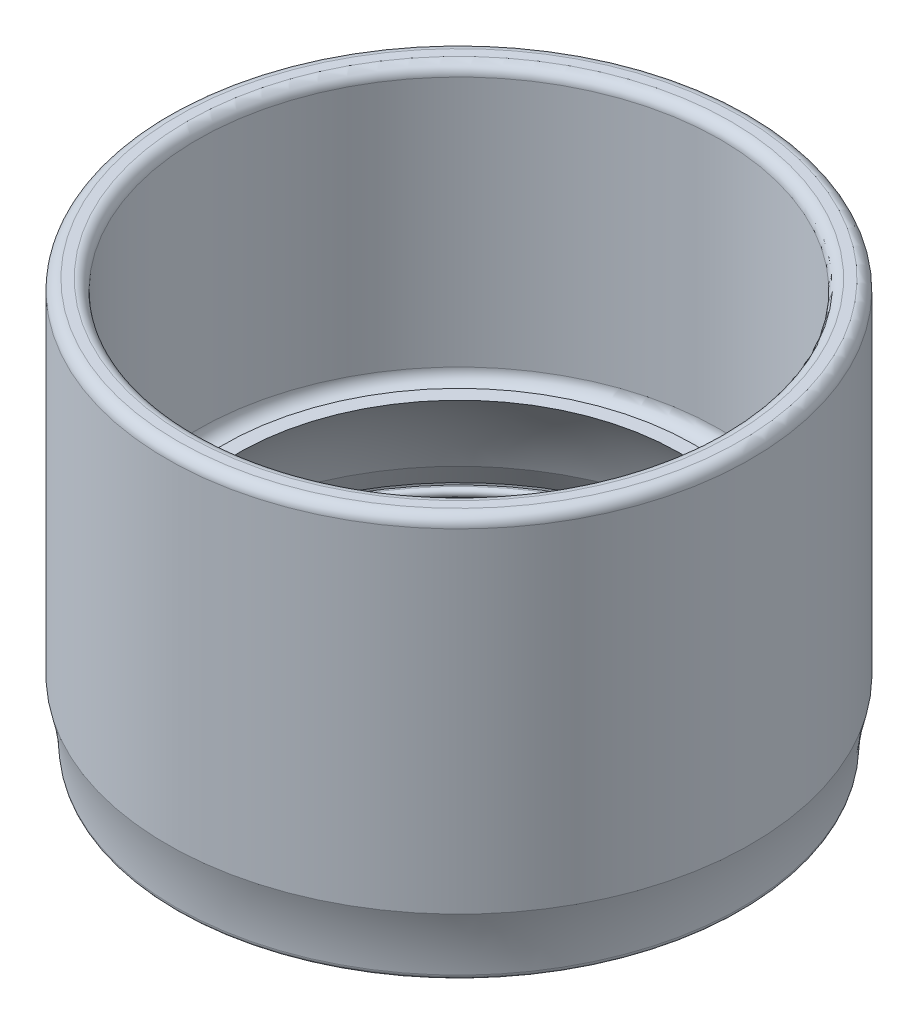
ISO-10303-21;
HEADER;
FILE_DESCRIPTION(('STEP AP214'),'2;1');
FILE_NAME('part.step','',(''),(''),'','','');
FILE_SCHEMA(('AUTOMOTIVE_DESIGN { 1 0 10303 214 1 1 1 1 }'));
ENDSEC;
DATA;
#1=APPLICATION_CONTEXT('core data for automotive mechanical design processes');
#2=APPLICATION_PROTOCOL_DEFINITION('international standard','automotive_design',2000,#1);
#3=PRODUCT_CONTEXT('',#1,'mechanical');
#4=PRODUCT('Part','Part','',(#3));
#5=PRODUCT_RELATED_PRODUCT_CATEGORY('part','',(#4));
#6=PRODUCT_DEFINITION_FORMATION('','',#4);
#7=PRODUCT_DEFINITION_CONTEXT('part definition',#1,'design');
#8=PRODUCT_DEFINITION('design','',#6,#7);
#9=PRODUCT_DEFINITION_SHAPE('','',#8);
#10=(LENGTH_UNIT() NAMED_UNIT(*) SI_UNIT(.MILLI.,.METRE.));
#11=(NAMED_UNIT(*) PLANE_ANGLE_UNIT() SI_UNIT($,.RADIAN.));
#12=(NAMED_UNIT(*) SI_UNIT($,.STERADIAN.) SOLID_ANGLE_UNIT());
#13=UNCERTAINTY_MEASURE_WITH_UNIT(LENGTH_MEASURE(1.E-05),#10,'distance_accuracy_value','');
#14=(GEOMETRIC_REPRESENTATION_CONTEXT(3) GLOBAL_UNCERTAINTY_ASSIGNED_CONTEXT((#13)) GLOBAL_UNIT_ASSIGNED_CONTEXT((#10,
#11,#12)) REPRESENTATION_CONTEXT('',''));
#15=CARTESIAN_POINT('',(0.,0.,0.));
#16=DIRECTION('',(0.,0.,1.));
#17=DIRECTION('',(1.,0.,0.));
#18=AXIS2_PLACEMENT_3D('',#15,#16,#17);
#19=CARTESIAN_POINT('',(0.,0.,0.));
#20=DIRECTION('',(0.,-1.,0.));
#21=DIRECTION('',(0.,0.,-1.));
#22=AXIS2_PLACEMENT_3D('',#19,#20,#21);
#23=CYLINDRICAL_SURFACE('',#22,82.7532);
#24=CARTESIAN_POINT('',(0.,11.7602,0.));
#25=DIRECTION('',(0.,-1.,0.));
#26=DIRECTION('',(0.,0.,-1.));
#27=AXIS2_PLACEMENT_3D('',#24,#25,#26);
#28=CIRCLE('',#27,82.7532);
#29=CARTESIAN_POINT('',(0.,11.7602,-82.7532));
#30=VERTEX_POINT('',#29);
#31=EDGE_CURVE('E81',#30,#30,#28,.T.);
#32=ORIENTED_EDGE('',*,*,#31,.F.);
#33=EDGE_LOOP('',(#32));
#34=FACE_BOUND('',#33,.T.);
#35=CARTESIAN_POINT('',(0.,11.1252,0.));
#36=DIRECTION('',(0.,-1.,0.));
#37=DIRECTION('',(0.,0.,-1.));
#38=AXIS2_PLACEMENT_3D('',#35,#36,#37);
#39=CIRCLE('',#38,82.7532);
#40=CARTESIAN_POINT('',(0.,11.1252,-82.7532));
#41=VERTEX_POINT('',#40);
#42=EDGE_CURVE('E51',#41,#41,#39,.T.);
#43=ORIENTED_EDGE('',*,*,#42,.T.);
#44=EDGE_LOOP('',(#43));
#45=FACE_BOUND('',#44,.T.);
#46=ADVANCED_FACE('F26',(#34,#45),#23,.F.);
#47=CARTESIAN_POINT('',(-82.7532,11.1252,0.));
#48=DIRECTION('',(0.,-1.,0.));
#49=DIRECTION('',(0.,0.,-1.));
#50=AXIS2_PLACEMENT_3D('',#47,#48,#49);
#51=PLANE('',#50);
#52=ORIENTED_EDGE('',*,*,#42,.F.);
#53=EDGE_LOOP('',(#52));
#54=FACE_BOUND('',#53,.T.);
#55=CARTESIAN_POINT('',(0.,11.1252,0.));
#56=DIRECTION('',(0.,-1.,0.));
#57=DIRECTION('',(0.,0.,-1.));
#58=AXIS2_PLACEMENT_3D('',#55,#56,#57);
#59=CIRCLE('',#58,82.2198);
#60=CARTESIAN_POINT('',(0.,11.1252,-82.2198));
#61=VERTEX_POINT('',#60);
#62=EDGE_CURVE('E54',#61,#61,#59,.T.);
#63=ORIENTED_EDGE('',*,*,#62,.T.);
#64=EDGE_LOOP('',(#63));
#65=FACE_BOUND('',#64,.T.);
#66=ADVANCED_FACE('F89',(#54,#65),#51,.F.);
#67=CARTESIAN_POINT('',(0.,9.85519999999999,0.));
#68=DIRECTION('',(0.,-1.,0.));
#69=DIRECTION('',(0.,0.,-1.));
#70=AXIS2_PLACEMENT_3D('',#67,#68,#69);
#71=TOROIDAL_SURFACE('',#70,82.2198,1.27000000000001);
#72=ORIENTED_EDGE('',*,*,#62,.F.);
#73=EDGE_LOOP('',(#72));
#74=FACE_BOUND('',#73,.T.);
#75=CARTESIAN_POINT('',(0.,8.636,0.));
#76=DIRECTION('',(0.,-1.,0.));
#77=DIRECTION('',(0.,0.,-1.));
#78=AXIS2_PLACEMENT_3D('',#75,#76,#77);
#79=CIRCLE('',#78,81.8641999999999);
#80=CARTESIAN_POINT('',(0.,8.636,-81.8641999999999));
#81=VERTEX_POINT('',#80);
#82=EDGE_CURVE('E57',#81,#81,#79,.T.);
#83=ORIENTED_EDGE('',*,*,#82,.T.);
#84=EDGE_LOOP('',(#83));
#85=FACE_BOUND('',#84,.T.);
#86=ADVANCED_FACE('F94',(#74,#85),#71,.T.);
#87=CARTESIAN_POINT('',(-81.8641999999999,8.636,0.));
#88=DIRECTION('',(0.,1.,0.));
#89=DIRECTION('',(0.,0.,1.));
#90=AXIS2_PLACEMENT_3D('',#87,#88,#89);
#91=PLANE('',#90);
#92=ORIENTED_EDGE('',*,*,#82,.F.);
#93=EDGE_LOOP('',(#92));
#94=FACE_BOUND('',#93,.T.);
#95=CARTESIAN_POINT('',(0.,8.636,0.));
#96=DIRECTION('',(0.,-1.,0.));
#97=DIRECTION('',(0.,0.,-1.));
#98=AXIS2_PLACEMENT_3D('',#95,#96,#97);
#99=CIRCLE('',#98,81.9912);
#100=CARTESIAN_POINT('',(0.,8.636,-81.9912));
#101=VERTEX_POINT('',#100);
#102=EDGE_CURVE('E60',#101,#101,#99,.T.);
#103=ORIENTED_EDGE('',*,*,#102,.T.);
#104=EDGE_LOOP('',(#103));
#105=FACE_BOUND('',#104,.T.);
#106=ADVANCED_FACE('F99',(#94,#105),#91,.F.);
#107=CARTESIAN_POINT('',(0.,0.,0.));
#108=DIRECTION('',(0.,-1.,0.));
#109=DIRECTION('',(0.,0.,-1.));
#110=AXIS2_PLACEMENT_3D('',#107,#108,#109);
#111=CYLINDRICAL_SURFACE('',#110,81.9912);
#112=ORIENTED_EDGE('',*,*,#102,.F.);
#113=EDGE_LOOP('',(#112));
#114=FACE_BOUND('',#113,.T.);
#115=CARTESIAN_POINT('',(0.,0.,0.));
#116=DIRECTION('',(0.,-1.,0.));
#117=DIRECTION('',(0.,0.,-1.));
#118=AXIS2_PLACEMENT_3D('',#115,#116,#117);
#119=CIRCLE('',#118,81.9912);
#120=CARTESIAN_POINT('',(0.,0.,-81.9912));
#121=VERTEX_POINT('',#120);
#122=EDGE_CURVE('E63',#121,#121,#119,.T.);
#123=ORIENTED_EDGE('',*,*,#122,.T.);
#124=EDGE_LOOP('',(#123));
#125=FACE_BOUND('',#124,.T.);
#126=ADVANCED_FACE('F105',(#114,#125),#111,.F.);
#127=CARTESIAN_POINT('',(-85.8012,0.,0.));
#128=DIRECTION('',(0.,1.,0.));
#129=DIRECTION('',(0.,0.,1.));
#130=AXIS2_PLACEMENT_3D('',#127,#128,#129);
#131=PLANE('',#130);
#132=CARTESIAN_POINT('',(0.,0.,0.));
#133=DIRECTION('',(0.,1.,0.));
#134=DIRECTION('',(0.,0.,1.));
#135=AXIS2_PLACEMENT_3D('',#132,#133,#134);
#136=CIRCLE('',#135,84.2492450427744);
#137=CARTESIAN_POINT('',(0.,0.,84.2492450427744));
#138=VERTEX_POINT('',#137);
#139=EDGE_CURVE('E32',#138,#138,#136,.F.);
#140=ORIENTED_EDGE('',*,*,#139,.T.);
#141=EDGE_LOOP('',(#140));
#142=FACE_BOUND('',#141,.T.);
#143=ORIENTED_EDGE('',*,*,#122,.F.);
#144=EDGE_LOOP('',(#143));
#145=FACE_BOUND('',#144,.T.);
#146=ADVANCED_FACE('F111',(#142,#145),#131,.F.);
#147=CARTESIAN_POINT('',(0.,-0.952242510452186,0.));
#148=DIRECTION('',(0.,-1.,0.));
#149=DIRECTION('',(0.,0.,-1.));
#150=AXIS2_PLACEMENT_3D('',#147,#148,#149);
#151=TOROIDAL_SURFACE('',#150,161.944445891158,76.1492);
#152=CARTESIAN_POINT('',(0.,1.53563464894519,0.));
#153=DIRECTION('',(0.,-1.,0.));
#154=DIRECTION('',(0.,0.,-1.));
#155=AXIS2_PLACEMENT_3D('',#152,#153,#154);
#156=CIRCLE('',#155,85.8358975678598);
#157=CARTESIAN_POINT('',(0.,1.53563464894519,-85.8358975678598));
#158=VERTEX_POINT('',#157);
#159=EDGE_CURVE('E10',#158,#158,#156,.F.);
#160=ORIENTED_EDGE('',*,*,#159,.T.);
#161=EDGE_LOOP('',(#160));
#162=FACE_BOUND('',#161,.T.);
#163=CARTESIAN_POINT('',(0.,19.5072,0.));
#164=DIRECTION('',(0.,-1.,0.));
#165=DIRECTION('',(0.,0.,-1.));
#166=AXIS2_PLACEMENT_3D('',#163,#164,#165);
#167=CIRCLE('',#166,88.5952);
#168=CARTESIAN_POINT('',(0.,19.5072,-88.5952));
#169=VERTEX_POINT('',#168);
#170=EDGE_CURVE('E66',#169,#169,#167,.T.);
#171=ORIENTED_EDGE('',*,*,#170,.T.);
#172=EDGE_LOOP('',(#171));
#173=FACE_BOUND('',#172,.T.);
#174=ADVANCED_FACE('F116',(#162,#173),#151,.F.);
#175=CARTESIAN_POINT('',(0.,0.,0.));
#176=DIRECTION('',(0.,-1.,0.));
#177=DIRECTION('',(0.,0.,-1.));
#178=AXIS2_PLACEMENT_3D('',#175,#176,#177);
#179=CYLINDRICAL_SURFACE('',#178,88.5952);
#180=CARTESIAN_POINT('',(0.,120.7262,0.));
#181=DIRECTION('',(0.,-1.,0.));
#182=DIRECTION('',(0.,0.,-1.));
#183=AXIS2_PLACEMENT_3D('',#180,#181,#182);
#184=CIRCLE('',#183,88.5952);
#185=CARTESIAN_POINT('',(0.,120.7262,-88.5952));
#186=VERTEX_POINT('',#185);
#187=EDGE_CURVE('E40',#186,#186,#184,.T.);
#188=ORIENTED_EDGE('',*,*,#187,.T.);
#189=EDGE_LOOP('',(#188));
#190=FACE_BOUND('',#189,.T.);
#191=ORIENTED_EDGE('',*,*,#170,.F.);
#192=EDGE_LOOP('',(#191));
#193=FACE_BOUND('',#192,.T.);
#194=ADVANCED_FACE('F121',(#190,#193),#179,.T.);
#195=CARTESIAN_POINT('',(-88.5952,123.9012,0.));
#196=DIRECTION('',(0.,-1.,0.));
#197=DIRECTION('',(0.,0.,-1.));
#198=AXIS2_PLACEMENT_3D('',#195,#196,#197);
#199=PLANE('',#198);
#200=CARTESIAN_POINT('',(0.,123.9012,0.));
#201=DIRECTION('',(0.,-1.,0.));
#202=DIRECTION('',(0.,0.,-1.));
#203=AXIS2_PLACEMENT_3D('',#200,#201,#202);
#204=CIRCLE('',#203,85.4202);
#205=CARTESIAN_POINT('',(0.,123.9012,-85.4202));
#206=VERTEX_POINT('',#205);
#207=EDGE_CURVE('E36',#206,#206,#204,.F.);
#208=ORIENTED_EDGE('',*,*,#207,.T.);
#209=EDGE_LOOP('',(#208));
#210=FACE_BOUND('',#209,.T.);
#211=CARTESIAN_POINT('',(0.,123.9012,0.));
#212=DIRECTION('',(0.,-1.,0.));
#213=DIRECTION('',(0.,0.,-1.));
#214=AXIS2_PLACEMENT_3D('',#211,#212,#213);
#215=CIRCLE('',#214,82.55);
#216=CARTESIAN_POINT('',(0.,123.9012,-82.55));
#217=VERTEX_POINT('',#216);
#218=EDGE_CURVE('E48',#217,#217,#215,.T.);
#219=ORIENTED_EDGE('',*,*,#218,.T.);
#220=EDGE_LOOP('',(#219));
#221=FACE_BOUND('',#220,.T.);
#222=ADVANCED_FACE('F126',(#210,#221),#199,.F.);
#223=CARTESIAN_POINT('',(0.,0.,0.));
#224=DIRECTION('',(0.,-1.,0.));
#225=DIRECTION('',(0.,0.,-1.));
#226=AXIS2_PLACEMENT_3D('',#223,#224,#225);
#227=CYLINDRICAL_SURFACE('',#226,79.375);
#228=CARTESIAN_POINT('',(0.,120.7262,0.));
#229=DIRECTION('',(0.,-1.,0.));
#230=DIRECTION('',(0.,0.,-1.));
#231=AXIS2_PLACEMENT_3D('',#228,#229,#230);
#232=CIRCLE('',#231,79.375);
#233=CARTESIAN_POINT('',(0.,120.7262,-79.375));
#234=VERTEX_POINT('',#233);
#235=EDGE_CURVE('E45',#234,#234,#232,.F.);
#236=ORIENTED_EDGE('',*,*,#235,.T.);
#237=EDGE_LOOP('',(#236));
#238=FACE_BOUND('',#237,.T.);
#239=CARTESIAN_POINT('',(0.,44.5262,0.));
#240=DIRECTION('',(0.,-1.,0.));
#241=DIRECTION('',(0.,0.,-1.));
#242=AXIS2_PLACEMENT_3D('',#239,#240,#241);
#243=CIRCLE('',#242,79.375);
#244=CARTESIAN_POINT('',(0.,44.5262,-79.375));
#245=VERTEX_POINT('',#244);
#246=EDGE_CURVE('E69',#245,#245,#243,.T.);
#247=ORIENTED_EDGE('',*,*,#246,.T.);
#248=EDGE_LOOP('',(#247));
#249=FACE_BOUND('',#248,.T.);
#250=ADVANCED_FACE('F130',(#238,#249),#227,.F.);
#251=CARTESIAN_POINT('',(0.,44.5262,0.));
#252=DIRECTION('',(0.,-1.,0.));
#253=DIRECTION('',(0.,0.,-1.));
#254=AXIS2_PLACEMENT_3D('',#251,#252,#253);
#255=TOROIDAL_SURFACE('',#254,75.40752,3.96747999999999);
#256=ORIENTED_EDGE('',*,*,#246,.F.);
#257=EDGE_LOOP('',(#256));
#258=FACE_BOUND('',#257,.T.);
#259=CARTESIAN_POINT('',(0.,44.5262,0.));
#260=DIRECTION('',(0.,-1.,0.));
#261=DIRECTION('',(0.,0.,-1.));
#262=AXIS2_PLACEMENT_3D('',#259,#260,#261);
#263=CIRCLE('',#262,71.44004);
#264=CARTESIAN_POINT('',(0.,44.5262,-71.44004));
#265=VERTEX_POINT('',#264);
#266=EDGE_CURVE('E72',#265,#265,#263,.T.);
#267=ORIENTED_EDGE('',*,*,#266,.T.);
#268=EDGE_LOOP('',(#267));
#269=FACE_BOUND('',#268,.T.);
#270=ADVANCED_FACE('F134',(#258,#269),#255,.F.);
#271=CARTESIAN_POINT('',(-71.44004,44.5262,0.));
#272=DIRECTION('',(0.,-1.,0.));
#273=DIRECTION('',(0.,0.,-1.));
#274=AXIS2_PLACEMENT_3D('',#271,#272,#273);
#275=PLANE('',#274);
#276=ORIENTED_EDGE('',*,*,#266,.F.);
#277=EDGE_LOOP('',(#276));
#278=FACE_BOUND('',#277,.T.);
#279=CARTESIAN_POINT('',(0.,44.5262,0.));
#280=DIRECTION('',(0.,-1.,0.));
#281=DIRECTION('',(0.,0.,-1.));
#282=AXIS2_PLACEMENT_3D('',#279,#280,#281);
#283=CIRCLE('',#282,67.0306);
#284=CARTESIAN_POINT('',(0.,44.5262,-67.0306));
#285=VERTEX_POINT('',#284);
#286=EDGE_CURVE('E75',#285,#285,#283,.T.);
#287=ORIENTED_EDGE('',*,*,#286,.T.);
#288=EDGE_LOOP('',(#287));
#289=FACE_BOUND('',#288,.T.);
#290=ADVANCED_FACE('F138',(#278,#289),#275,.F.);
#291=CARTESIAN_POINT('',(0.,-4.14327894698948,0.));
#292=DIRECTION('',(0.,-1.,0.));
#293=DIRECTION('',(0.,0.,-1.));
#294=AXIS2_PLACEMENT_3D('',#291,#292,#293);
#295=DEGENERATE_TOROIDAL_SURFACE('',#294,0.0858683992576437,82.9056,.F.);
#296=ORIENTED_EDGE('',*,*,#286,.F.);
#297=EDGE_LOOP('',(#296));
#298=FACE_BOUND('',#297,.T.);
#299=CARTESIAN_POINT('',(0.,18.1864,0.));
#300=DIRECTION('',(0.,-1.,0.));
#301=DIRECTION('',(0.,0.,-1.));
#302=AXIS2_PLACEMENT_3D('',#299,#300,#301);
#303=CIRCLE('',#302,79.756);
#304=CARTESIAN_POINT('',(0.,18.1864,-79.756));
#305=VERTEX_POINT('',#304);
#306=EDGE_CURVE('E78',#305,#305,#303,.T.);
#307=ORIENTED_EDGE('',*,*,#306,.T.);
#308=EDGE_LOOP('',(#307));
#309=FACE_BOUND('',#308,.T.);
#310=ADVANCED_FACE('F142',(#298,#309),#295,.T.);
#311=CARTESIAN_POINT('',(0.,11.7602,0.));
#312=DIRECTION('',(0.,-1.,0.));
#313=DIRECTION('',(0.,0.,-1.));
#314=AXIS2_PLACEMENT_3D('',#311,#312,#313);
#315=CONICAL_SURFACE('',#314,82.7532,0.436410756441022);
#316=ORIENTED_EDGE('',*,*,#306,.F.);
#317=EDGE_LOOP('',(#316));
#318=FACE_BOUND('',#317,.T.);
#319=ORIENTED_EDGE('',*,*,#31,.T.);
#320=EDGE_LOOP('',(#319));
#321=FACE_BOUND('',#320,.T.);
#322=ADVANCED_FACE('F85',(#318,#321),#315,.F.);
#323=CARTESIAN_POINT('',(0.,120.7262,0.));
#324=DIRECTION('',(0.,-1.,0.));
#325=DIRECTION('',(0.,0.,-1.));
#326=AXIS2_PLACEMENT_3D('',#323,#324,#325);
#327=TOROIDAL_SURFACE('',#326,82.55,3.175);
#328=ORIENTED_EDGE('',*,*,#235,.F.);
#329=EDGE_LOOP('',(#328));
#330=FACE_BOUND('',#329,.T.);
#331=ORIENTED_EDGE('',*,*,#218,.F.);
#332=EDGE_LOOP('',(#331));
#333=FACE_BOUND('',#332,.T.);
#334=ADVANCED_FACE('F149',(#330,#333),#327,.T.);
#335=CARTESIAN_POINT('',(0.,120.7262,0.));
#336=DIRECTION('',(0.,-1.,0.));
#337=DIRECTION('',(0.,0.,-1.));
#338=AXIS2_PLACEMENT_3D('',#335,#336,#337);
#339=TOROIDAL_SURFACE('',#338,85.4202,3.175);
#340=ORIENTED_EDGE('',*,*,#207,.F.);
#341=EDGE_LOOP('',(#340));
#342=FACE_BOUND('',#341,.T.);
#343=ORIENTED_EDGE('',*,*,#187,.F.);
#344=EDGE_LOOP('',(#343));
#345=FACE_BOUND('',#344,.T.);
#346=ADVANCED_FACE('F153',(#342,#345),#339,.T.);
#347=CARTESIAN_POINT('',(0.,1.5875,0.));
#348=DIRECTION('',(0.,-1.,0.));
#349=DIRECTION('',(0.,0.,-1.));
#350=AXIS2_PLACEMENT_3D('',#347,#348,#349);
#351=TOROIDAL_SURFACE('',#350,84.2492450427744,1.5875);
#352=ORIENTED_EDGE('',*,*,#159,.F.);
#353=EDGE_LOOP('',(#352));
#354=FACE_BOUND('',#353,.T.);
#355=ORIENTED_EDGE('',*,*,#139,.F.);
#356=EDGE_LOOP('',(#355));
#357=FACE_BOUND('',#356,.T.);
#358=ADVANCED_FACE('F157',(#354,#357),#351,.T.);
#359=CLOSED_SHELL('',(#46,#66,#86,#106,#126,#146,#174,#194,#222,#250,#270,#290,#310,#322,#334,
#346,#358));
#360=MANIFOLD_SOLID_BREP('B2',#359);
#361=ADVANCED_BREP_SHAPE_REPRESENTATION('',(#18,#360),#14);
#362=SHAPE_DEFINITION_REPRESENTATION(#9,#361);
ENDSEC;
END-ISO-10303-21;
